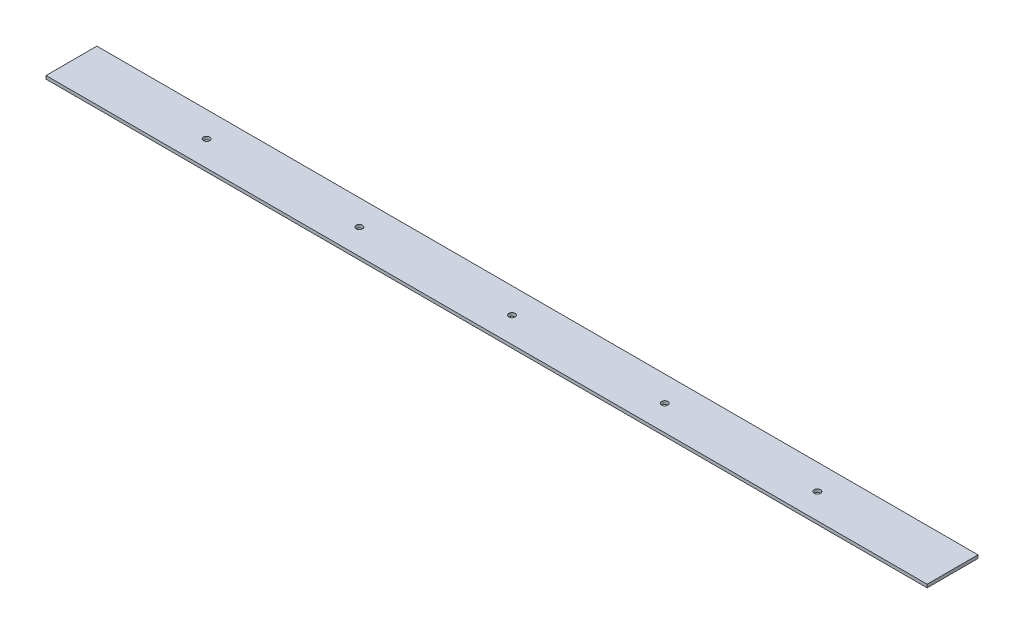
ISO-10303-21;
HEADER;
FILE_DESCRIPTION(('STEP AP214'),'2;1');
FILE_NAME('part.step','',(''),(''),'','','');
FILE_SCHEMA(('AUTOMOTIVE_DESIGN { 1 0 10303 214 1 1 1 1 }'));
ENDSEC;
DATA;
#1=APPLICATION_CONTEXT('core data for automotive mechanical design processes');
#2=APPLICATION_PROTOCOL_DEFINITION('international standard','automotive_design',2000,#1);
#3=PRODUCT_CONTEXT('',#1,'mechanical');
#4=PRODUCT('Part','Part','',(#3));
#5=PRODUCT_RELATED_PRODUCT_CATEGORY('part','',(#4));
#6=PRODUCT_DEFINITION_FORMATION('','',#4);
#7=PRODUCT_DEFINITION_CONTEXT('part definition',#1,'design');
#8=PRODUCT_DEFINITION('design','',#6,#7);
#9=PRODUCT_DEFINITION_SHAPE('','',#8);
#10=(LENGTH_UNIT() NAMED_UNIT(*) SI_UNIT(.MILLI.,.METRE.));
#11=(NAMED_UNIT(*) PLANE_ANGLE_UNIT() SI_UNIT($,.RADIAN.));
#12=(NAMED_UNIT(*) SI_UNIT($,.STERADIAN.) SOLID_ANGLE_UNIT());
#13=UNCERTAINTY_MEASURE_WITH_UNIT(LENGTH_MEASURE(1.E-05),#10,'distance_accuracy_value','');
#14=(GEOMETRIC_REPRESENTATION_CONTEXT(3) GLOBAL_UNCERTAINTY_ASSIGNED_CONTEXT((#13)) GLOBAL_UNIT_ASSIGNED_CONTEXT((#10,
#11,#12)) REPRESENTATION_CONTEXT('',''));
#15=CARTESIAN_POINT('',(0.,0.,0.));
#16=DIRECTION('',(0.,0.,1.));
#17=DIRECTION('',(1.,0.,0.));
#18=AXIS2_PLACEMENT_3D('',#15,#16,#17);
#19=CARTESIAN_POINT('',(465.187061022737,1.5875,0.));
#20=DIRECTION('',(0.,-1.,0.));
#21=DIRECTION('',(0.,0.,-1.));
#22=AXIS2_PLACEMENT_3D('',#19,#20,#21);
#23=PLANE('',#22);
#24=CARTESIAN_POINT('',(372.26875,1.5875,12.7));
#25=DIRECTION('',(0.,-1.,0.));
#26=DIRECTION('',(0.,0.,-1.));
#27=AXIS2_PLACEMENT_3D('',#24,#25,#26);
#28=CIRCLE('',#27,1.58750000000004);
#29=CARTESIAN_POINT('',(372.26875,1.5875,11.1125));
#30=VERTEX_POINT('',#29);
#31=EDGE_CURVE('E135',#30,#30,#28,.T.);
#32=ORIENTED_EDGE('',*,*,#31,.T.);
#33=EDGE_LOOP('',(#32));
#34=FACE_BOUND('',#33,.T.);
#35=CARTESIAN_POINT('',(296.06875,1.5875,12.7));
#36=DIRECTION('',(0.,-1.,0.));
#37=DIRECTION('',(0.,0.,-1.));
#38=AXIS2_PLACEMENT_3D('',#35,#36,#37);
#39=CIRCLE('',#38,1.58750000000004);
#40=CARTESIAN_POINT('',(296.06875,1.5875,11.1125));
#41=VERTEX_POINT('',#40);
#42=EDGE_CURVE('E134',#41,#41,#39,.T.);
#43=ORIENTED_EDGE('',*,*,#42,.T.);
#44=EDGE_LOOP('',(#43));
#45=FACE_BOUND('',#44,.T.);
#46=CARTESIAN_POINT('',(67.46875,1.5875,12.7));
#47=DIRECTION('',(0.,-1.,0.));
#48=DIRECTION('',(0.,0.,-1.));
#49=AXIS2_PLACEMENT_3D('',#46,#47,#48);
#50=CIRCLE('',#49,1.58750000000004);
#51=CARTESIAN_POINT('',(67.46875,1.5875,11.1125));
#52=VERTEX_POINT('',#51);
#53=EDGE_CURVE('E141',#52,#52,#50,.T.);
#54=ORIENTED_EDGE('',*,*,#53,.T.);
#55=EDGE_LOOP('',(#54));
#56=FACE_BOUND('',#55,.T.);
#57=CARTESIAN_POINT('',(143.66875,1.5875,12.7));
#58=DIRECTION('',(0.,-1.,0.));
#59=DIRECTION('',(0.,0.,-1.));
#60=AXIS2_PLACEMENT_3D('',#57,#58,#59);
#61=CIRCLE('',#60,1.58750000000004);
#62=CARTESIAN_POINT('',(143.66875,1.5875,11.1125));
#63=VERTEX_POINT('',#62);
#64=EDGE_CURVE('E127',#63,#63,#61,.T.);
#65=ORIENTED_EDGE('',*,*,#64,.T.);
#66=EDGE_LOOP('',(#65));
#67=FACE_BOUND('',#66,.T.);
#68=CARTESIAN_POINT('',(219.86875,1.5875,12.7));
#69=DIRECTION('',(0.,-1.,0.));
#70=DIRECTION('',(0.,0.,-1.));
#71=AXIS2_PLACEMENT_3D('',#68,#69,#70);
#72=CIRCLE('',#71,1.58750000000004);
#73=CARTESIAN_POINT('',(219.86875,1.5875,11.1125));
#74=VERTEX_POINT('',#73);
#75=EDGE_CURVE('E116',#74,#74,#72,.T.);
#76=ORIENTED_EDGE('',*,*,#75,.T.);
#77=EDGE_LOOP('',(#76));
#78=FACE_BOUND('',#77,.T.);
#79=DIRECTION('',(0.,0.,-1.));
#80=VECTOR('',#79,1.);
#81=CARTESIAN_POINT('',(439.7375,1.5875,0.));
#82=LINE('',#81,#80);
#83=CARTESIAN_POINT('',(439.7375,1.5875,0.));
#84=VERTEX_POINT('',#83);
#85=CARTESIAN_POINT('',(439.7375,1.5875,25.4));
#86=VERTEX_POINT('',#85);
#87=EDGE_CURVE('E82',#84,#86,#82,.F.);
#88=ORIENTED_EDGE('',*,*,#87,.F.);
#89=DIRECTION('',(-1.,0.,0.));
#90=VECTOR('',#89,1.);
#91=CARTESIAN_POINT('',(465.187061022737,1.5875,0.));
#92=LINE('',#91,#90);
#93=CARTESIAN_POINT('',(0.,1.5875,0.));
#94=VERTEX_POINT('',#93);
#95=EDGE_CURVE('E66',#84,#94,#92,.T.);
#96=ORIENTED_EDGE('',*,*,#95,.T.);
#97=DIRECTION('',(0.,0.,-1.));
#98=VECTOR('',#97,1.);
#99=CARTESIAN_POINT('',(0.,1.5875,0.));
#100=LINE('',#99,#98);
#101=CARTESIAN_POINT('',(0.,1.5875,25.4));
#102=VERTEX_POINT('',#101);
#103=EDGE_CURVE('E93',#94,#102,#100,.F.);
#104=ORIENTED_EDGE('',*,*,#103,.T.);
#105=DIRECTION('',(-1.,0.,0.));
#106=VECTOR('',#105,1.);
#107=CARTESIAN_POINT('',(465.187061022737,1.5875,25.4));
#108=LINE('',#107,#106);
#109=EDGE_CURVE('E11',#86,#102,#108,.T.);
#110=ORIENTED_EDGE('',*,*,#109,.F.);
#111=EDGE_LOOP('',(#88,#96,#104,#110));
#112=FACE_BOUND('',#111,.T.);
#113=ADVANCED_FACE('F44',(#34,#45,#56,#67,#78,#112),#23,.F.);
#114=CARTESIAN_POINT('',(465.187061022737,0.,25.4));
#115=DIRECTION('',(0.,0.,1.));
#116=DIRECTION('',(1.,0.,0.));
#117=AXIS2_PLACEMENT_3D('',#114,#115,#116);
#118=PLANE('',#117);
#119=DIRECTION('',(-1.,0.,0.));
#120=VECTOR('',#119,1.);
#121=CARTESIAN_POINT('',(465.187061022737,0.,25.4));
#122=LINE('',#121,#120);
#123=CARTESIAN_POINT('',(439.7375,0.,25.4));
#124=VERTEX_POINT('',#123);
#125=CARTESIAN_POINT('',(0.,0.,25.4));
#126=VERTEX_POINT('',#125);
#127=EDGE_CURVE('E51',#124,#126,#122,.T.);
#128=ORIENTED_EDGE('',*,*,#127,.F.);
#129=DIRECTION('',(0.,-1.,0.));
#130=VECTOR('',#129,1.);
#131=CARTESIAN_POINT('',(439.7375,0.,25.4));
#132=LINE('',#131,#130);
#133=EDGE_CURVE('E85',#124,#86,#132,.F.);
#134=ORIENTED_EDGE('',*,*,#133,.T.);
#135=ORIENTED_EDGE('',*,*,#109,.T.);
#136=DIRECTION('',(0.,1.,0.));
#137=VECTOR('',#136,1.);
#138=CARTESIAN_POINT('',(0.,0.,25.4));
#139=LINE('',#138,#137);
#140=EDGE_CURVE('E99',#126,#102,#139,.T.);
#141=ORIENTED_EDGE('',*,*,#140,.F.);
#142=EDGE_LOOP('',(#128,#134,#135,#141));
#143=FACE_BOUND('',#142,.T.);
#144=ADVANCED_FACE('F91',(#143),#118,.T.);
#145=CARTESIAN_POINT('',(465.187061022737,0.,0.));
#146=DIRECTION('',(0.,-1.,0.));
#147=DIRECTION('',(0.,0.,-1.));
#148=AXIS2_PLACEMENT_3D('',#145,#146,#147);
#149=PLANE('',#148);
#150=CARTESIAN_POINT('',(372.26875,0.,12.7));
#151=DIRECTION('',(0.,-1.,0.));
#152=DIRECTION('',(0.,0.,-1.));
#153=AXIS2_PLACEMENT_3D('',#150,#151,#152);
#154=CIRCLE('',#153,1.58750000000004);
#155=CARTESIAN_POINT('',(372.26875,0.,11.1125));
#156=VERTEX_POINT('',#155);
#157=EDGE_CURVE('E131',#156,#156,#154,.T.);
#158=ORIENTED_EDGE('',*,*,#157,.F.);
#159=EDGE_LOOP('',(#158));
#160=FACE_BOUND('',#159,.T.);
#161=CARTESIAN_POINT('',(296.06875,0.,12.7));
#162=DIRECTION('',(0.,-1.,0.));
#163=DIRECTION('',(0.,0.,-1.));
#164=AXIS2_PLACEMENT_3D('',#161,#162,#163);
#165=CIRCLE('',#164,1.58750000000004);
#166=CARTESIAN_POINT('',(296.06875,0.,11.1125));
#167=VERTEX_POINT('',#166);
#168=EDGE_CURVE('E138',#167,#167,#165,.T.);
#169=ORIENTED_EDGE('',*,*,#168,.F.);
#170=EDGE_LOOP('',(#169));
#171=FACE_BOUND('',#170,.T.);
#172=CARTESIAN_POINT('',(67.46875,0.,12.7));
#173=DIRECTION('',(0.,-1.,0.));
#174=DIRECTION('',(0.,0.,-1.));
#175=AXIS2_PLACEMENT_3D('',#172,#173,#174);
#176=CIRCLE('',#175,1.58750000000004);
#177=CARTESIAN_POINT('',(67.46875,0.,11.1125));
#178=VERTEX_POINT('',#177);
#179=EDGE_CURVE('E130',#178,#178,#176,.T.);
#180=ORIENTED_EDGE('',*,*,#179,.F.);
#181=EDGE_LOOP('',(#180));
#182=FACE_BOUND('',#181,.T.);
#183=CARTESIAN_POINT('',(143.66875,0.,12.7));
#184=DIRECTION('',(0.,-1.,0.));
#185=DIRECTION('',(0.,0.,-1.));
#186=AXIS2_PLACEMENT_3D('',#183,#184,#185);
#187=CIRCLE('',#186,1.58750000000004);
#188=CARTESIAN_POINT('',(143.66875,0.,11.1125));
#189=VERTEX_POINT('',#188);
#190=EDGE_CURVE('E123',#189,#189,#187,.T.);
#191=ORIENTED_EDGE('',*,*,#190,.F.);
#192=EDGE_LOOP('',(#191));
#193=FACE_BOUND('',#192,.T.);
#194=CARTESIAN_POINT('',(219.86875,0.,12.7));
#195=DIRECTION('',(0.,-1.,0.));
#196=DIRECTION('',(0.,0.,-1.));
#197=AXIS2_PLACEMENT_3D('',#194,#195,#196);
#198=CIRCLE('',#197,1.58750000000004);
#199=CARTESIAN_POINT('',(219.86875,0.,11.1125));
#200=VERTEX_POINT('',#199);
#201=EDGE_CURVE('E119',#200,#200,#198,.T.);
#202=ORIENTED_EDGE('',*,*,#201,.F.);
#203=EDGE_LOOP('',(#202));
#204=FACE_BOUND('',#203,.T.);
#205=DIRECTION('',(-1.,0.,0.));
#206=VECTOR('',#205,1.);
#207=CARTESIAN_POINT('',(465.187061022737,0.,0.));
#208=LINE('',#207,#206);
#209=CARTESIAN_POINT('',(439.7375,0.,0.));
#210=VERTEX_POINT('',#209);
#211=CARTESIAN_POINT('',(0.,0.,0.));
#212=VERTEX_POINT('',#211);
#213=EDGE_CURVE('E112',#210,#212,#208,.T.);
#214=ORIENTED_EDGE('',*,*,#213,.F.);
#215=DIRECTION('',(0.,0.,1.));
#216=VECTOR('',#215,1.);
#217=CARTESIAN_POINT('',(439.7375,0.,0.));
#218=LINE('',#217,#216);
#219=EDGE_CURVE('E58',#210,#124,#218,.T.);
#220=ORIENTED_EDGE('',*,*,#219,.T.);
#221=ORIENTED_EDGE('',*,*,#127,.T.);
#222=DIRECTION('',(0.,0.,1.));
#223=VECTOR('',#222,1.);
#224=CARTESIAN_POINT('',(0.,0.,0.));
#225=LINE('',#224,#223);
#226=EDGE_CURVE('E104',#212,#126,#225,.T.);
#227=ORIENTED_EDGE('',*,*,#226,.F.);
#228=EDGE_LOOP('',(#214,#220,#221,#227));
#229=FACE_BOUND('',#228,.T.);
#230=ADVANCED_FACE('F115',(#160,#171,#182,#193,#204,#229),#149,.T.);
#231=CARTESIAN_POINT('',(465.187061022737,1.5875,0.));
#232=DIRECTION('',(0.,0.,-1.));
#233=DIRECTION('',(-1.,0.,0.));
#234=AXIS2_PLACEMENT_3D('',#231,#232,#233);
#235=PLANE('',#234);
#236=ORIENTED_EDGE('',*,*,#95,.F.);
#237=DIRECTION('',(0.,-1.,0.));
#238=VECTOR('',#237,1.);
#239=CARTESIAN_POINT('',(439.7375,0.,0.));
#240=LINE('',#239,#238);
#241=EDGE_CURVE('E86',#210,#84,#240,.F.);
#242=ORIENTED_EDGE('',*,*,#241,.F.);
#243=ORIENTED_EDGE('',*,*,#213,.T.);
#244=DIRECTION('',(0.,-1.,0.));
#245=VECTOR('',#244,1.);
#246=CARTESIAN_POINT('',(0.,1.5875,0.));
#247=LINE('',#246,#245);
#248=EDGE_CURVE('E106',#94,#212,#247,.T.);
#249=ORIENTED_EDGE('',*,*,#248,.F.);
#250=EDGE_LOOP('',(#236,#242,#243,#249));
#251=FACE_BOUND('',#250,.T.);
#252=ADVANCED_FACE('F161',(#251),#235,.T.);
#253=CARTESIAN_POINT('',(0.,0.,0.));
#254=DIRECTION('',(1.,0.,0.));
#255=DIRECTION('',(0.,0.,-1.));
#256=AXIS2_PLACEMENT_3D('',#253,#254,#255);
#257=PLANE('',#256);
#258=ORIENTED_EDGE('',*,*,#103,.F.);
#259=ORIENTED_EDGE('',*,*,#248,.T.);
#260=ORIENTED_EDGE('',*,*,#226,.T.);
#261=ORIENTED_EDGE('',*,*,#140,.T.);
#262=EDGE_LOOP('',(#258,#259,#260,#261));
#263=FACE_BOUND('',#262,.T.);
#264=ADVANCED_FACE('F102',(#263),#257,.F.);
#265=CARTESIAN_POINT('',(439.7375,0.,0.));
#266=DIRECTION('',(1.,0.,0.));
#267=DIRECTION('',(0.,0.,1.));
#268=AXIS2_PLACEMENT_3D('',#265,#266,#267);
#269=PLANE('',#268);
#270=ORIENTED_EDGE('',*,*,#133,.F.);
#271=ORIENTED_EDGE('',*,*,#219,.F.);
#272=ORIENTED_EDGE('',*,*,#241,.T.);
#273=ORIENTED_EDGE('',*,*,#87,.T.);
#274=EDGE_LOOP('',(#270,#271,#272,#273));
#275=FACE_BOUND('',#274,.T.);
#276=ADVANCED_FACE('F84',(#275),#269,.T.);
#277=CARTESIAN_POINT('',(219.86875,1.5875,12.7));
#278=DIRECTION('',(0.,-1.,0.));
#279=DIRECTION('',(0.,0.,-1.));
#280=AXIS2_PLACEMENT_3D('',#277,#278,#279);
#281=CYLINDRICAL_SURFACE('',#280,1.58750000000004);
#282=ORIENTED_EDGE('',*,*,#75,.F.);
#283=EDGE_LOOP('',(#282));
#284=FACE_BOUND('',#283,.T.);
#285=ORIENTED_EDGE('',*,*,#201,.T.);
#286=EDGE_LOOP('',(#285));
#287=FACE_BOUND('',#286,.T.);
#288=ADVANCED_FACE('F168',(#284,#287),#281,.F.);
#289=CARTESIAN_POINT('',(143.66875,1.5875,12.7));
#290=DIRECTION('',(0.,-1.,0.));
#291=DIRECTION('',(0.,0.,-1.));
#292=AXIS2_PLACEMENT_3D('',#289,#290,#291);
#293=CYLINDRICAL_SURFACE('',#292,1.58750000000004);
#294=ORIENTED_EDGE('',*,*,#64,.F.);
#295=EDGE_LOOP('',(#294));
#296=FACE_BOUND('',#295,.T.);
#297=ORIENTED_EDGE('',*,*,#190,.T.);
#298=EDGE_LOOP('',(#297));
#299=FACE_BOUND('',#298,.T.);
#300=ADVANCED_FACE('F155',(#296,#299),#293,.F.);
#301=CARTESIAN_POINT('',(67.46875,1.5875,12.7));
#302=DIRECTION('',(0.,-1.,0.));
#303=DIRECTION('',(0.,0.,-1.));
#304=AXIS2_PLACEMENT_3D('',#301,#302,#303);
#305=CYLINDRICAL_SURFACE('',#304,1.58750000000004);
#306=ORIENTED_EDGE('',*,*,#53,.F.);
#307=EDGE_LOOP('',(#306));
#308=FACE_BOUND('',#307,.T.);
#309=ORIENTED_EDGE('',*,*,#179,.T.);
#310=EDGE_LOOP('',(#309));
#311=FACE_BOUND('',#310,.T.);
#312=ADVANCED_FACE('F151',(#308,#311),#305,.F.);
#313=CARTESIAN_POINT('',(296.06875,1.5875,12.7));
#314=DIRECTION('',(0.,-1.,0.));
#315=DIRECTION('',(0.,0.,-1.));
#316=AXIS2_PLACEMENT_3D('',#313,#314,#315);
#317=CYLINDRICAL_SURFACE('',#316,1.58750000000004);
#318=ORIENTED_EDGE('',*,*,#42,.F.);
#319=EDGE_LOOP('',(#318));
#320=FACE_BOUND('',#319,.T.);
#321=ORIENTED_EDGE('',*,*,#168,.T.);
#322=EDGE_LOOP('',(#321));
#323=FACE_BOUND('',#322,.T.);
#324=ADVANCED_FACE('F154',(#320,#323),#317,.F.);
#325=CARTESIAN_POINT('',(372.26875,1.5875,12.7));
#326=DIRECTION('',(0.,-1.,0.));
#327=DIRECTION('',(0.,0.,-1.));
#328=AXIS2_PLACEMENT_3D('',#325,#326,#327);
#329=CYLINDRICAL_SURFACE('',#328,1.58750000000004);
#330=ORIENTED_EDGE('',*,*,#31,.F.);
#331=EDGE_LOOP('',(#330));
#332=FACE_BOUND('',#331,.T.);
#333=ORIENTED_EDGE('',*,*,#157,.T.);
#334=EDGE_LOOP('',(#333));
#335=FACE_BOUND('',#334,.T.);
#336=ADVANCED_FACE('F191',(#332,#335),#329,.F.);
#337=CLOSED_SHELL('',(#113,#144,#230,#252,#264,#276,#288,#300,#312,#324,#336));
#338=MANIFOLD_SOLID_BREP('B2',#337);
#339=ADVANCED_BREP_SHAPE_REPRESENTATION('',(#18,#338),#14);
#340=SHAPE_DEFINITION_REPRESENTATION(#9,#339);
ENDSEC;
END-ISO-10303-21;
